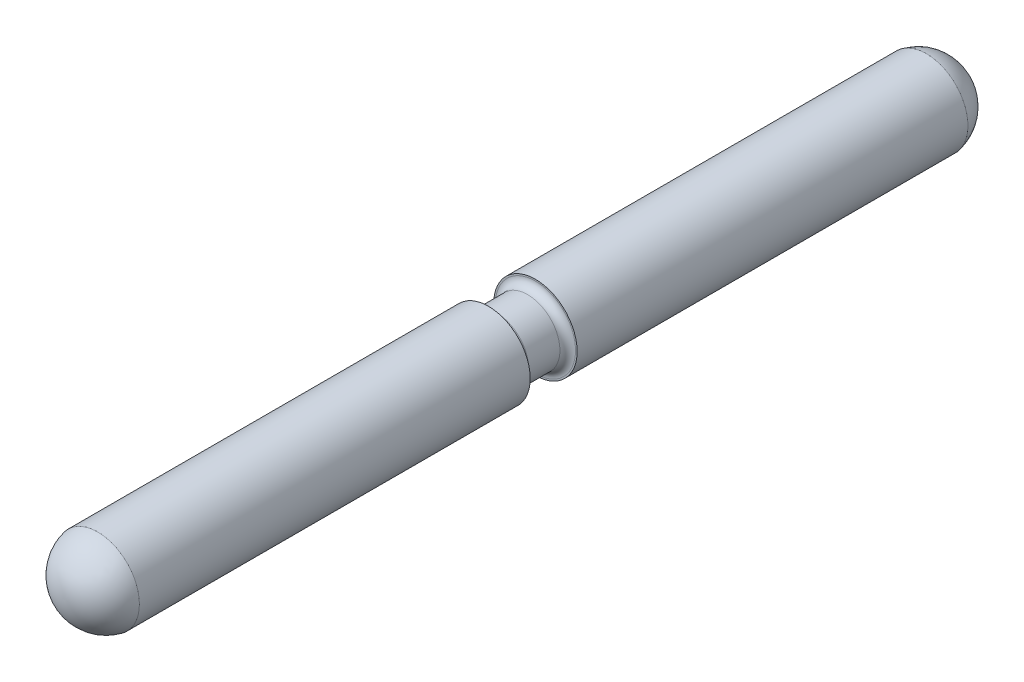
ISO-10303-21;
HEADER;
FILE_DESCRIPTION(('STEP AP214'),'2;1');
FILE_NAME('part.step','',(''),(''),'','','');
FILE_SCHEMA(('AUTOMOTIVE_DESIGN { 1 0 10303 214 1 1 1 1 }'));
ENDSEC;
DATA;
#1=APPLICATION_CONTEXT('core data for automotive mechanical design processes');
#2=APPLICATION_PROTOCOL_DEFINITION('international standard','automotive_design',2000,#1);
#3=PRODUCT_CONTEXT('',#1,'mechanical');
#4=PRODUCT('Part','Part','',(#3));
#5=PRODUCT_RELATED_PRODUCT_CATEGORY('part','',(#4));
#6=PRODUCT_DEFINITION_FORMATION('','',#4);
#7=PRODUCT_DEFINITION_CONTEXT('part definition',#1,'design');
#8=PRODUCT_DEFINITION('design','',#6,#7);
#9=PRODUCT_DEFINITION_SHAPE('','',#8);
#10=(LENGTH_UNIT() NAMED_UNIT(*) SI_UNIT(.MILLI.,.METRE.));
#11=(NAMED_UNIT(*) PLANE_ANGLE_UNIT() SI_UNIT($,.RADIAN.));
#12=(NAMED_UNIT(*) SI_UNIT($,.STERADIAN.) SOLID_ANGLE_UNIT());
#13=UNCERTAINTY_MEASURE_WITH_UNIT(LENGTH_MEASURE(1.E-05),#10,'distance_accuracy_value','');
#14=(GEOMETRIC_REPRESENTATION_CONTEXT(3) GLOBAL_UNCERTAINTY_ASSIGNED_CONTEXT((#13)) GLOBAL_UNIT_ASSIGNED_CONTEXT((#10,
#11,#12)) REPRESENTATION_CONTEXT('',''));
#15=CARTESIAN_POINT('',(0.,0.,0.));
#16=DIRECTION('',(0.,0.,1.));
#17=DIRECTION('',(1.,0.,0.));
#18=AXIS2_PLACEMENT_3D('',#15,#16,#17);
#19=CARTESIAN_POINT('',(0.14511484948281,0.,-71.983168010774));
#20=DIRECTION('',(0.,-1.,0.));
#21=DIRECTION('',(1.,0.,0.));
#22=AXIS2_PLACEMENT_3D('',#19,#20,#21);
#23=CIRCLE('',#22,8.00000000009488);
#24=TRIMMED_CURVE('',#23,(PARAMETER_VALUE(-1.58893667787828)),
(PARAMETER_VALUE(1.58893667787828)),.T.,.PARAMETER.);
#25=CARTESIAN_POINT('',(0.,0.,-71.983168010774));
#26=DIRECTION('',(0.,0.,1.));
#27=AXIS1_PLACEMENT('',#25,#26);
#28=SURFACE_OF_REVOLUTION('',#24,#27);
#29=CARTESIAN_POINT('',(0.,0.,-79.9818517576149));
#30=VERTEX_POINT('',#29);
#31=VERTEX_LOOP('',#30);
#32=FACE_BOUND('',#31,.T.);
#33=CARTESIAN_POINT('',(0.,0.,-73.5));
#34=DIRECTION('',(0.,0.,1.));
#35=DIRECTION('',(1.,0.,0.));
#36=AXIS2_PLACEMENT_3D('',#33,#34,#35);
#37=CIRCLE('',#36,8.);
#38=CARTESIAN_POINT('',(8.,0.,-73.5));
#39=VERTEX_POINT('',#38);
#40=EDGE_CURVE('E54',#39,#39,#37,.T.);
#41=ORIENTED_EDGE('',*,*,#40,.F.);
#42=EDGE_LOOP('',(#41));
#43=FACE_BOUND('',#42,.T.);
#44=ADVANCED_FACE('F32',(#32,#43),#28,.T.);
#45=CARTESIAN_POINT('',(0.,0.,-73.5));
#46=DIRECTION('',(0.,0.,1.));
#47=DIRECTION('',(1.,0.,0.));
#48=AXIS2_PLACEMENT_3D('',#45,#46,#47);
#49=CYLINDRICAL_SURFACE('',#48,8.);
#50=CARTESIAN_POINT('',(0.,0.,1.5));
#51=DIRECTION('',(0.,0.,1.));
#52=DIRECTION('',(1.,0.,0.));
#53=AXIS2_PLACEMENT_3D('',#50,#51,#52);
#54=CIRCLE('',#53,8.);
#55=CARTESIAN_POINT('',(8.,0.,1.5));
#56=VERTEX_POINT('',#55);
#57=EDGE_CURVE('E36',#56,#56,#54,.F.);
#58=ORIENTED_EDGE('',*,*,#57,.T.);
#59=EDGE_LOOP('',(#58));
#60=FACE_BOUND('',#59,.T.);
#61=ORIENTED_EDGE('',*,*,#40,.T.);
#62=EDGE_LOOP('',(#61));
#63=FACE_BOUND('',#62,.T.);
#64=ADVANCED_FACE('F50',(#60,#63),#49,.T.);
#65=CARTESIAN_POINT('',(8.096,-8.123858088,1.5));
#66=DIRECTION('',(0.,0.,-1.));
#67=DIRECTION('',(-1.,0.,0.));
#68=AXIS2_PLACEMENT_3D('',#65,#66,#67);
#69=PLANE('',#68);
#70=CARTESIAN_POINT('',(0.,0.,1.5));
#71=DIRECTION('',(0.,0.,-1.));
#72=DIRECTION('',(-1.,0.,0.));
#73=AXIS2_PLACEMENT_3D('',#70,#71,#72);
#74=CIRCLE('',#73,7.7);
#75=CARTESIAN_POINT('',(-7.7,0.,1.5));
#76=VERTEX_POINT('',#75);
#77=EDGE_CURVE('E58',#76,#76,#74,.T.);
#78=ORIENTED_EDGE('',*,*,#77,.T.);
#79=EDGE_LOOP('',(#78));
#80=FACE_BOUND('',#79,.T.);
#81=ORIENTED_EDGE('',*,*,#57,.F.);
#82=EDGE_LOOP('',(#81));
#83=FACE_BOUND('',#82,.T.);
#84=ADVANCED_FACE('F104',(#80,#83),#69,.F.);
#85=CARTESIAN_POINT('',(0.,-0.145114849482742,83.983168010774));
#86=DIRECTION('',(-1.,0.,0.));
#87=DIRECTION('',(0.,-1.,0.));
#88=AXIS2_PLACEMENT_3D('',#85,#86,#87);
#89=CIRCLE('',#88,8.00000000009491);
#90=TRIMMED_CURVE('',#89,(PARAMETER_VALUE(-1.58893667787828)),
(PARAMETER_VALUE(1.58893667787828)),.T.,.PARAMETER.);
#91=CARTESIAN_POINT('',(0.,0.,83.983168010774));
#92=DIRECTION('',(0.,0.,1.));
#93=AXIS1_PLACEMENT('',#91,#92);
#94=SURFACE_OF_REVOLUTION('',#90,#93);
#95=CARTESIAN_POINT('',(0.,0.,91.9818517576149));
#96=VERTEX_POINT('',#95);
#97=VERTEX_LOOP('',#96);
#98=FACE_BOUND('',#97,.T.);
#99=CARTESIAN_POINT('',(0.,0.,85.5));
#100=DIRECTION('',(0.,0.,1.));
#101=DIRECTION('',(1.,0.,0.));
#102=AXIS2_PLACEMENT_3D('',#99,#100,#101);
#103=CIRCLE('',#102,8.);
#104=CARTESIAN_POINT('',(8.,0.,85.5));
#105=VERTEX_POINT('',#104);
#106=EDGE_CURVE('E60',#105,#105,#103,.F.);
#107=ORIENTED_EDGE('',*,*,#106,.F.);
#108=EDGE_LOOP('',(#107));
#109=FACE_BOUND('',#108,.T.);
#110=ADVANCED_FACE('F99',(#98,#109),#94,.T.);
#111=CARTESIAN_POINT('',(0.,0.,3.));
#112=DIRECTION('',(0.,0.,-1.));
#113=DIRECTION('',(-1.,0.,0.));
#114=AXIS2_PLACEMENT_3D('',#111,#112,#113);
#115=TOROIDAL_SURFACE('',#114,7.7,1.5);
#116=CARTESIAN_POINT('',(0.,0.,3.));
#117=DIRECTION('',(0.,0.,1.));
#118=DIRECTION('',(1.,0.,0.));
#119=AXIS2_PLACEMENT_3D('',#116,#117,#118);
#120=CIRCLE('',#119,6.2);
#121=CARTESIAN_POINT('',(6.2,0.,3.));
#122=VERTEX_POINT('',#121);
#123=EDGE_CURVE('E65',#122,#122,#120,.T.);
#124=ORIENTED_EDGE('',*,*,#123,.F.);
#125=EDGE_LOOP('',(#124));
#126=FACE_BOUND('',#125,.T.);
#127=ORIENTED_EDGE('',*,*,#77,.F.);
#128=EDGE_LOOP('',(#127));
#129=FACE_BOUND('',#128,.T.);
#130=ADVANCED_FACE('F92',(#126,#129),#115,.F.);
#131=CARTESIAN_POINT('',(0.,0.,10.5));
#132=DIRECTION('',(0.,0.,1.));
#133=DIRECTION('',(1.,0.,0.));
#134=AXIS2_PLACEMENT_3D('',#131,#132,#133);
#135=CYLINDRICAL_SURFACE('',#134,8.);
#136=ORIENTED_EDGE('',*,*,#106,.T.);
#137=EDGE_LOOP('',(#136));
#138=FACE_BOUND('',#137,.T.);
#139=CARTESIAN_POINT('',(0.,0.,10.5));
#140=DIRECTION('',(0.,0.,1.));
#141=DIRECTION('',(1.,0.,0.));
#142=AXIS2_PLACEMENT_3D('',#139,#140,#141);
#143=CIRCLE('',#142,8.);
#144=CARTESIAN_POINT('',(8.,0.,10.5));
#145=VERTEX_POINT('',#144);
#146=EDGE_CURVE('E63',#145,#145,#143,.T.);
#147=ORIENTED_EDGE('',*,*,#146,.T.);
#148=EDGE_LOOP('',(#147));
#149=FACE_BOUND('',#148,.T.);
#150=ADVANCED_FACE('F90',(#138,#149),#135,.T.);
#151=CARTESIAN_POINT('',(0.,0.,3.));
#152=DIRECTION('',(0.,0.,1.));
#153=DIRECTION('',(1.,0.,0.));
#154=AXIS2_PLACEMENT_3D('',#151,#152,#153);
#155=CYLINDRICAL_SURFACE('',#154,6.2);
#156=ORIENTED_EDGE('',*,*,#123,.T.);
#157=EDGE_LOOP('',(#156));
#158=FACE_BOUND('',#157,.T.);
#159=CARTESIAN_POINT('',(0.,0.,9.));
#160=DIRECTION('',(0.,0.,-1.));
#161=DIRECTION('',(-1.,0.,0.));
#162=AXIS2_PLACEMENT_3D('',#159,#160,#161);
#163=CIRCLE('',#162,6.2);
#164=CARTESIAN_POINT('',(-6.2,0.,9.));
#165=VERTEX_POINT('',#164);
#166=EDGE_CURVE('E42',#165,#165,#163,.T.);
#167=ORIENTED_EDGE('',*,*,#166,.T.);
#168=EDGE_LOOP('',(#167));
#169=FACE_BOUND('',#168,.T.);
#170=ADVANCED_FACE('F79',(#158,#169),#155,.T.);
#171=CARTESIAN_POINT('',(-8.096,-8.123858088,10.5));
#172=DIRECTION('',(0.,0.,1.));
#173=DIRECTION('',(1.,0.,0.));
#174=AXIS2_PLACEMENT_3D('',#171,#172,#173);
#175=PLANE('',#174);
#176=CARTESIAN_POINT('',(0.,0.,10.5));
#177=DIRECTION('',(0.,0.,1.));
#178=DIRECTION('',(1.,0.,0.));
#179=AXIS2_PLACEMENT_3D('',#176,#177,#178);
#180=CIRCLE('',#179,7.7);
#181=CARTESIAN_POINT('',(7.7,0.,10.5));
#182=VERTEX_POINT('',#181);
#183=EDGE_CURVE('E11',#182,#182,#180,.T.);
#184=ORIENTED_EDGE('',*,*,#183,.T.);
#185=EDGE_LOOP('',(#184));
#186=FACE_BOUND('',#185,.T.);
#187=ORIENTED_EDGE('',*,*,#146,.F.);
#188=EDGE_LOOP('',(#187));
#189=FACE_BOUND('',#188,.T.);
#190=ADVANCED_FACE('F83',(#186,#189),#175,.F.);
#191=CARTESIAN_POINT('',(0.,0.,9.));
#192=DIRECTION('',(0.,0.,1.));
#193=DIRECTION('',(1.,0.,0.));
#194=AXIS2_PLACEMENT_3D('',#191,#192,#193);
#195=TOROIDAL_SURFACE('',#194,7.7,1.5);
#196=ORIENTED_EDGE('',*,*,#166,.F.);
#197=EDGE_LOOP('',(#196));
#198=FACE_BOUND('',#197,.T.);
#199=ORIENTED_EDGE('',*,*,#183,.F.);
#200=EDGE_LOOP('',(#199));
#201=FACE_BOUND('',#200,.T.);
#202=ADVANCED_FACE('F34',(#198,#201),#195,.F.);
#203=CLOSED_SHELL('',(#44,#64,#84,#110,#130,#150,#170,#190,#202));
#204=MANIFOLD_SOLID_BREP('B2',#203);
#205=ADVANCED_BREP_SHAPE_REPRESENTATION('',(#18,#204),#14);
#206=SHAPE_DEFINITION_REPRESENTATION(#9,#205);
ENDSEC;
END-ISO-10303-21;
